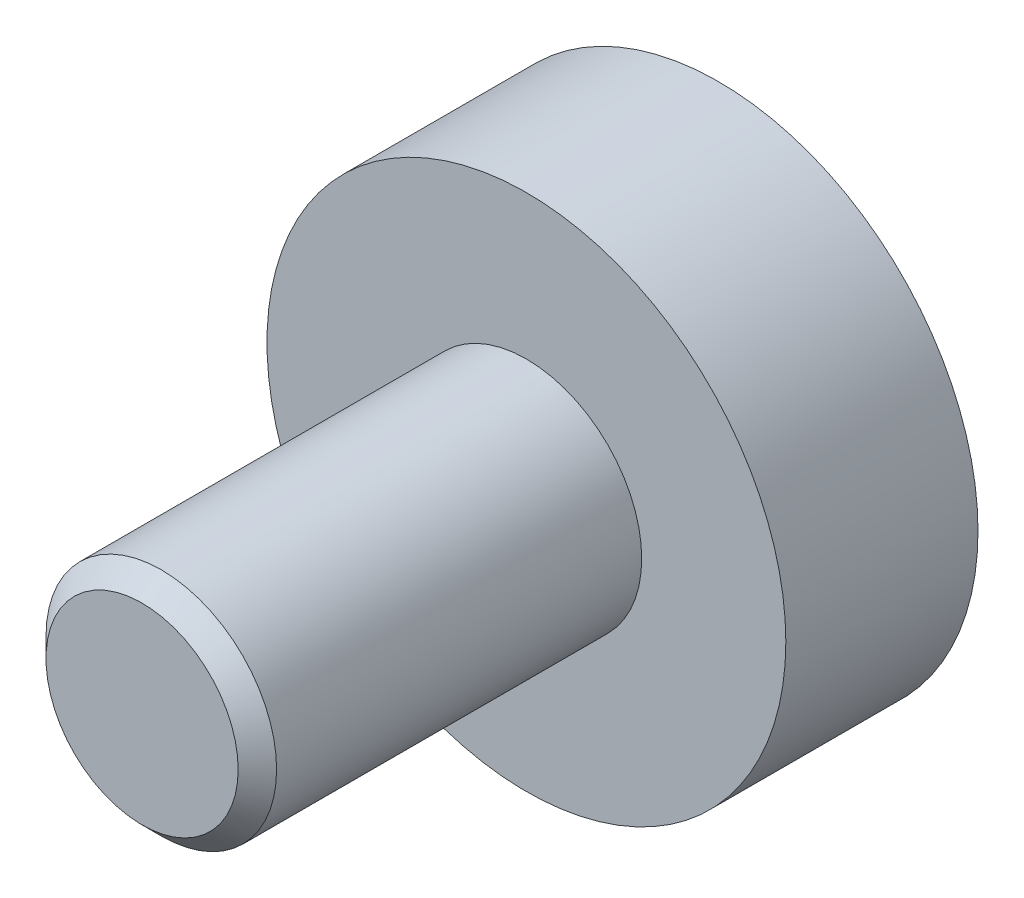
ISO-10303-21;
HEADER;
FILE_DESCRIPTION(('STEP AP214'),'2;1');
FILE_NAME('part.step','',(''),(''),'','','');
FILE_SCHEMA(('AUTOMOTIVE_DESIGN { 1 0 10303 214 1 1 1 1 }'));
ENDSEC;
DATA;
#1=APPLICATION_CONTEXT('core data for automotive mechanical design processes');
#2=APPLICATION_PROTOCOL_DEFINITION('international standard','automotive_design',2000,#1);
#3=PRODUCT_CONTEXT('',#1,'mechanical');
#4=PRODUCT('Part','Part','',(#3));
#5=PRODUCT_RELATED_PRODUCT_CATEGORY('part','',(#4));
#6=PRODUCT_DEFINITION_FORMATION('','',#4);
#7=PRODUCT_DEFINITION_CONTEXT('part definition',#1,'design');
#8=PRODUCT_DEFINITION('design','',#6,#7);
#9=PRODUCT_DEFINITION_SHAPE('','',#8);
#10=(LENGTH_UNIT() NAMED_UNIT(*) SI_UNIT(.MILLI.,.METRE.));
#11=(NAMED_UNIT(*) PLANE_ANGLE_UNIT() SI_UNIT($,.RADIAN.));
#12=(NAMED_UNIT(*) SI_UNIT($,.STERADIAN.) SOLID_ANGLE_UNIT());
#13=UNCERTAINTY_MEASURE_WITH_UNIT(LENGTH_MEASURE(1.E-05),#10,'distance_accuracy_value','');
#14=(GEOMETRIC_REPRESENTATION_CONTEXT(3) GLOBAL_UNCERTAINTY_ASSIGNED_CONTEXT((#13)) GLOBAL_UNIT_ASSIGNED_CONTEXT((#10,
#11,#12)) REPRESENTATION_CONTEXT('',''));
#15=CARTESIAN_POINT('',(0.,0.,0.));
#16=DIRECTION('',(0.,0.,1.));
#17=DIRECTION('',(1.,0.,0.));
#18=AXIS2_PLACEMENT_3D('',#15,#16,#17);
#19=CARTESIAN_POINT('',(0.,0.,10.));
#20=DIRECTION('',(0.,0.,1.));
#21=DIRECTION('',(1.,0.,0.));
#22=AXIS2_PLACEMENT_3D('',#19,#20,#21);
#23=PLANE('',#22);
#24=CARTESIAN_POINT('',(0.,0.,10.));
#25=DIRECTION('',(0.,0.,1.));
#26=DIRECTION('',(1.,0.,0.));
#27=AXIS2_PLACEMENT_3D('',#24,#25,#26);
#28=CIRCLE('',#27,13.5);
#29=CARTESIAN_POINT('',(13.5,0.,10.));
#30=VERTEX_POINT('',#29);
#31=EDGE_CURVE('E41',#30,#30,#28,.T.);
#32=ORIENTED_EDGE('',*,*,#31,.T.);
#33=EDGE_LOOP('',(#32));
#34=FACE_BOUND('',#33,.T.);
#35=CARTESIAN_POINT('',(0.,0.,10.));
#36=DIRECTION('',(0.,0.,1.));
#37=DIRECTION('',(1.,0.,0.));
#38=AXIS2_PLACEMENT_3D('',#35,#36,#37);
#39=CIRCLE('',#38,6.);
#40=CARTESIAN_POINT('',(6.,0.,10.));
#41=VERTEX_POINT('',#40);
#42=EDGE_CURVE('E45',#41,#41,#39,.T.);
#43=ORIENTED_EDGE('',*,*,#42,.F.);
#44=EDGE_LOOP('',(#43));
#45=FACE_BOUND('',#44,.T.);
#46=ADVANCED_FACE('F30',(#34,#45),#23,.T.);
#47=CARTESIAN_POINT('',(0.,0.,10.));
#48=DIRECTION('',(0.,0.,-1.));
#49=DIRECTION('',(-1.,0.,0.));
#50=AXIS2_PLACEMENT_3D('',#47,#48,#49);
#51=CYLINDRICAL_SURFACE('',#50,13.5);
#52=ORIENTED_EDGE('',*,*,#31,.F.);
#53=EDGE_LOOP('',(#52));
#54=FACE_BOUND('',#53,.T.);
#55=CARTESIAN_POINT('',(0.,0.,0.));
#56=DIRECTION('',(0.,0.,1.));
#57=DIRECTION('',(1.,0.,0.));
#58=AXIS2_PLACEMENT_3D('',#55,#56,#57);
#59=CIRCLE('',#58,13.5);
#60=CARTESIAN_POINT('',(13.5,0.,0.));
#61=VERTEX_POINT('',#60);
#62=EDGE_CURVE('E50',#61,#61,#59,.T.);
#63=ORIENTED_EDGE('',*,*,#62,.T.);
#64=EDGE_LOOP('',(#63));
#65=FACE_BOUND('',#64,.T.);
#66=ADVANCED_FACE('F54',(#54,#65),#51,.T.);
#67=CARTESIAN_POINT('',(0.,0.,30.));
#68=DIRECTION('',(0.,0.,-1.));
#69=DIRECTION('',(-1.,0.,0.));
#70=AXIS2_PLACEMENT_3D('',#67,#68,#69);
#71=CYLINDRICAL_SURFACE('',#70,6.);
#72=CARTESIAN_POINT('',(0.,0.,29.));
#73=DIRECTION('',(0.,0.,1.));
#74=DIRECTION('',(1.,0.,0.));
#75=AXIS2_PLACEMENT_3D('',#72,#73,#74);
#76=CIRCLE('',#75,6.);
#77=CARTESIAN_POINT('',(6.,0.,29.));
#78=VERTEX_POINT('',#77);
#79=EDGE_CURVE('E10',#78,#78,#76,.F.);
#80=ORIENTED_EDGE('',*,*,#79,.T.);
#81=EDGE_LOOP('',(#80));
#82=FACE_BOUND('',#81,.T.);
#83=ORIENTED_EDGE('',*,*,#42,.T.);
#84=EDGE_LOOP('',(#83));
#85=FACE_BOUND('',#84,.T.);
#86=ADVANCED_FACE('F71',(#82,#85),#71,.T.);
#87=CARTESIAN_POINT('',(0.,0.,30.));
#88=DIRECTION('',(0.,0.,1.));
#89=DIRECTION('',(1.,0.,0.));
#90=AXIS2_PLACEMENT_3D('',#87,#88,#89);
#91=PLANE('',#90);
#92=CARTESIAN_POINT('',(0.,0.,30.));
#93=DIRECTION('',(0.,0.,1.));
#94=DIRECTION('',(1.,0.,0.));
#95=AXIS2_PLACEMENT_3D('',#92,#93,#94);
#96=CIRCLE('',#95,5.);
#97=CARTESIAN_POINT('',(5.,0.,30.));
#98=VERTEX_POINT('',#97);
#99=EDGE_CURVE('E37',#98,#98,#96,.T.);
#100=ORIENTED_EDGE('',*,*,#99,.T.);
#101=EDGE_LOOP('',(#100));
#102=FACE_BOUND('',#101,.T.);
#103=ADVANCED_FACE('F62',(#102),#91,.T.);
#104=CARTESIAN_POINT('',(0.,0.,30.));
#105=DIRECTION('',(0.,0.,-1.));
#106=DIRECTION('',(-1.,0.,0.));
#107=AXIS2_PLACEMENT_3D('',#104,#105,#106);
#108=CONICAL_SURFACE('',#107,5.,0.785398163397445);
#109=ORIENTED_EDGE('',*,*,#79,.F.);
#110=EDGE_LOOP('',(#109));
#111=FACE_BOUND('',#110,.T.);
#112=ORIENTED_EDGE('',*,*,#99,.F.);
#113=EDGE_LOOP('',(#112));
#114=FACE_BOUND('',#113,.T.);
#115=ADVANCED_FACE('F32',(#111,#114),#108,.T.);
#116=CARTESIAN_POINT('',(0.,0.,-26.7908566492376));
#117=DIRECTION('',(0.,0.,-1.));
#118=DIRECTION('',(1.,0.,0.));
#119=AXIS2_PLACEMENT_3D('',#116,#117,#118);
#120=SPHERICAL_SURFACE('',#119,30.);
#121=ORIENTED_EDGE('',*,*,#62,.F.);
#122=EDGE_LOOP('',(#121));
#123=FACE_BOUND('',#122,.T.);
#124=ADVANCED_FACE('F56',(#123),#120,.F.);
#125=CLOSED_SHELL('',(#46,#66,#86,#103,#115,#124));
#126=MANIFOLD_SOLID_BREP('B2',#125);
#127=ADVANCED_BREP_SHAPE_REPRESENTATION('',(#18,#126),#14);
#128=SHAPE_DEFINITION_REPRESENTATION(#9,#127);
ENDSEC;
END-ISO-10303-21;
